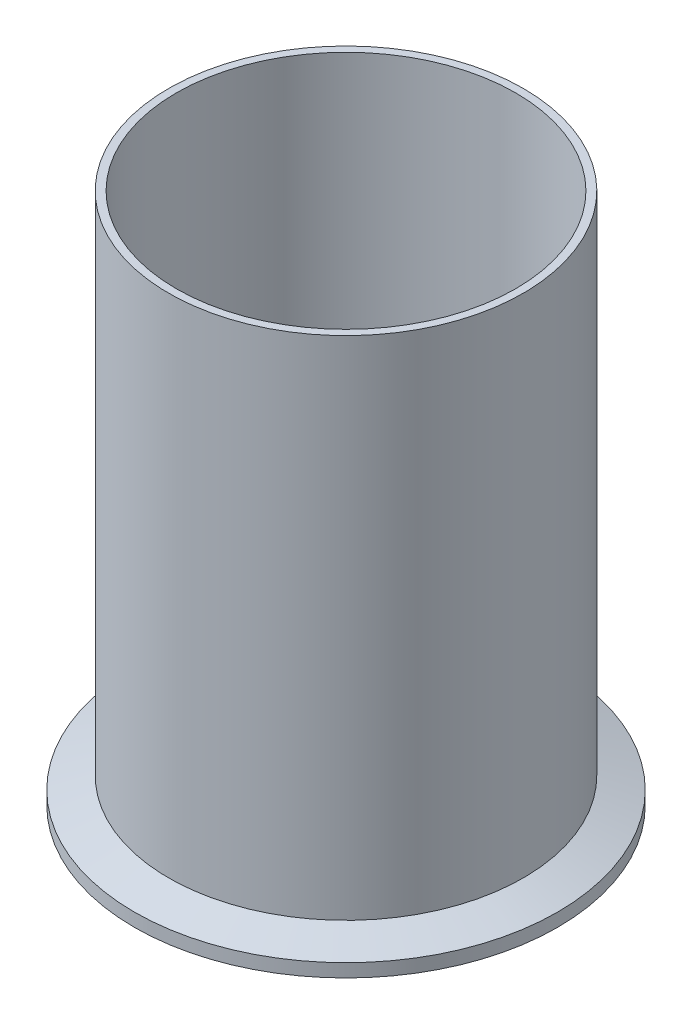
from build123d import *


with BuildPart() as part:
    # Sketch1 → Revolve2 (revolve)
    with BuildSketch(Plane.XY, mode=Mode.PRIVATE) as revolve2_sk:
        with BuildLine():
            Line((-36.449, 0), (-36.449, 114.3))
            Line((-36.449, 114.3), (-38.1, 114.3))
            Line((-38.1, 114.3), (-38.1, 5.521182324))
            Line((-38.1, 5.521182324), (-45.4533, 2.8448))
            Line((-45.4533, 2.8448), (-45.4533, 0))
            Line((-45.4533, 0), (-43.486708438, 0))
            ThreePointArc((-43.486708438, 0), (-43.054511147, 0.129217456), (-42.764166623, 0.474458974))
            ThreePointArc((-42.764166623, 0.474458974), (-41.6687, 1.1938), (-40.573233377, 0.474458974))
            ThreePointArc((-40.573233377, 0.474458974), (-40.282888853, 0.129217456), (-39.850691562, 0))
            Line((-39.850691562, 0), (-36.449, 0))
        make_face()
    revolve(revolve2_sk.sketch.rotate(Axis((0, 0, 0), (0, 1, 0)), 270), axis=Axis((0, 0, 0), (0, 1, 0)))


solid = part.part
